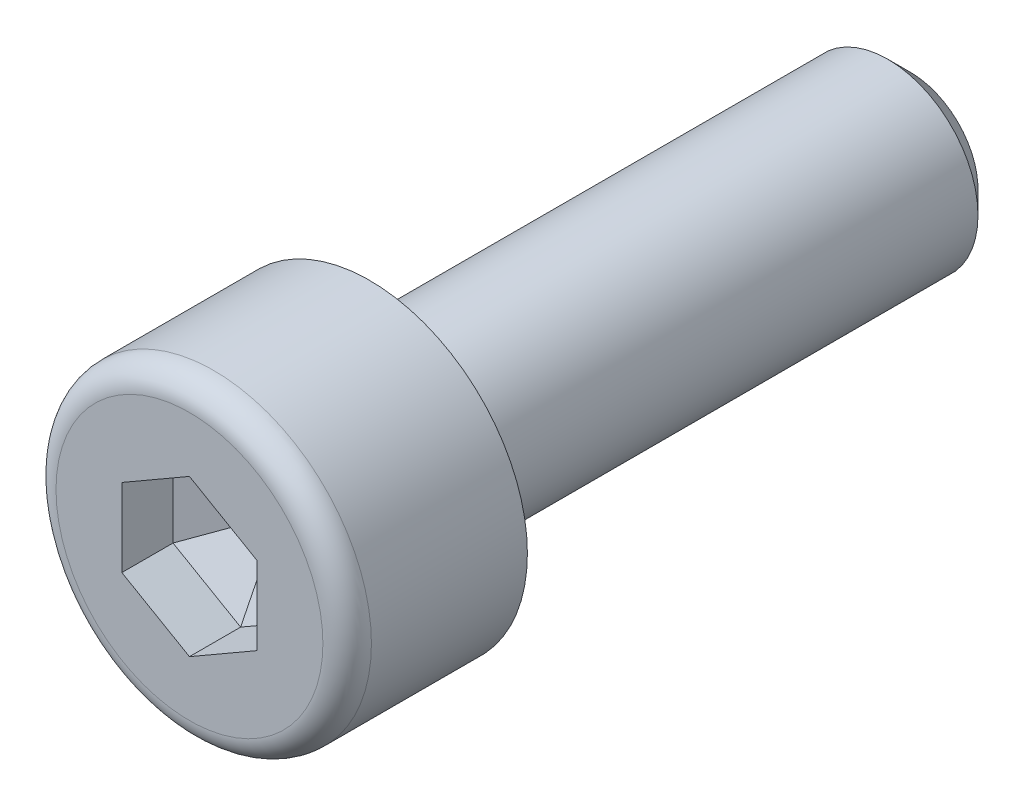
ISO-10303-21;
HEADER;
FILE_DESCRIPTION(('STEP AP214'),'2;1');
FILE_NAME('part.step','',(''),(''),'','','');
FILE_SCHEMA(('AUTOMOTIVE_DESIGN { 1 0 10303 214 1 1 1 1 }'));
ENDSEC;
DATA;
#1=APPLICATION_CONTEXT('core data for automotive mechanical design processes');
#2=APPLICATION_PROTOCOL_DEFINITION('international standard','automotive_design',2000,#1);
#3=PRODUCT_CONTEXT('',#1,'mechanical');
#4=PRODUCT('Part','Part','',(#3));
#5=PRODUCT_RELATED_PRODUCT_CATEGORY('part','',(#4));
#6=PRODUCT_DEFINITION_FORMATION('','',#4);
#7=PRODUCT_DEFINITION_CONTEXT('part definition',#1,'design');
#8=PRODUCT_DEFINITION('design','',#6,#7);
#9=PRODUCT_DEFINITION_SHAPE('','',#8);
#10=(LENGTH_UNIT() NAMED_UNIT(*) SI_UNIT(.MILLI.,.METRE.));
#11=(NAMED_UNIT(*) PLANE_ANGLE_UNIT() SI_UNIT($,.RADIAN.));
#12=(NAMED_UNIT(*) SI_UNIT($,.STERADIAN.) SOLID_ANGLE_UNIT());
#13=UNCERTAINTY_MEASURE_WITH_UNIT(LENGTH_MEASURE(1.E-05),#10,'distance_accuracy_value','');
#14=(GEOMETRIC_REPRESENTATION_CONTEXT(3) GLOBAL_UNCERTAINTY_ASSIGNED_CONTEXT((#13)) GLOBAL_UNIT_ASSIGNED_CONTEXT((#10,
#11,#12)) REPRESENTATION_CONTEXT('',''));
#15=CARTESIAN_POINT('',(0.,0.,0.));
#16=DIRECTION('',(0.,0.,1.));
#17=DIRECTION('',(1.,0.,0.));
#18=AXIS2_PLACEMENT_3D('',#15,#16,#17);
#19=CARTESIAN_POINT('',(0.,0.,0.));
#20=DIRECTION('',(0.,0.,1.));
#21=DIRECTION('',(1.,0.,0.));
#22=AXIS2_PLACEMENT_3D('',#19,#20,#21);
#23=PLANE('',#22);
#24=CARTESIAN_POINT('',(0.,0.,0.));
#25=DIRECTION('',(0.,0.,1.));
#26=DIRECTION('',(1.,0.,0.));
#27=AXIS2_PLACEMENT_3D('',#24,#25,#26);
#28=CIRCLE('',#27,2.1);
#29=CARTESIAN_POINT('',(2.1,0.,0.));
#30=VERTEX_POINT('',#29);
#31=EDGE_CURVE('E11',#30,#30,#28,.T.);
#32=ORIENTED_EDGE('',*,*,#31,.T.);
#33=EDGE_LOOP('',(#32));
#34=FACE_BOUND('',#33,.T.);
#35=CARTESIAN_POINT('',(0.,0.,0.));
#36=DIRECTION('',(0.,0.,1.));
#37=DIRECTION('',(1.,0.,0.));
#38=AXIS2_PLACEMENT_3D('',#35,#36,#37);
#39=CIRCLE('',#38,3.5);
#40=CARTESIAN_POINT('',(3.5,0.,0.));
#41=VERTEX_POINT('',#40);
#42=EDGE_CURVE('E160',#41,#41,#39,.T.);
#43=ORIENTED_EDGE('',*,*,#42,.F.);
#44=EDGE_LOOP('',(#43));
#45=FACE_BOUND('',#44,.T.);
#46=ADVANCED_FACE('F50',(#34,#45),#23,.F.);
#47=CARTESIAN_POINT('',(0.,0.,4.));
#48=DIRECTION('',(0.,0.,-1.));
#49=DIRECTION('',(-1.,0.,0.));
#50=AXIS2_PLACEMENT_3D('',#47,#48,#49);
#51=CYLINDRICAL_SURFACE('',#50,3.5);
#52=CARTESIAN_POINT('',(0.,0.,3.46153846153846));
#53=DIRECTION('',(0.,0.,1.));
#54=DIRECTION('',(1.,0.,0.));
#55=AXIS2_PLACEMENT_3D('',#52,#53,#54);
#56=CIRCLE('',#55,3.5);
#57=CARTESIAN_POINT('',(3.5,0.,3.46153846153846));
#58=VERTEX_POINT('',#57);
#59=EDGE_CURVE('E178',#58,#58,#56,.F.);
#60=ORIENTED_EDGE('',*,*,#59,.T.);
#61=EDGE_LOOP('',(#60));
#62=FACE_BOUND('',#61,.T.);
#63=ORIENTED_EDGE('',*,*,#42,.T.);
#64=EDGE_LOOP('',(#63));
#65=FACE_BOUND('',#64,.T.);
#66=ADVANCED_FACE('F237',(#62,#65),#51,.T.);
#67=CARTESIAN_POINT('',(0.,0.,4.));
#68=DIRECTION('',(0.,0.,1.));
#69=DIRECTION('',(1.,0.,0.));
#70=AXIS2_PLACEMENT_3D('',#67,#68,#69);
#71=PLANE('',#70);
#72=CARTESIAN_POINT('',(0.,0.,4.));
#73=DIRECTION('',(0.,0.,1.));
#74=DIRECTION('',(1.,0.,0.));
#75=AXIS2_PLACEMENT_3D('',#72,#73,#74);
#76=CIRCLE('',#75,2.96153846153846);
#77=CARTESIAN_POINT('',(2.96153846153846,0.,4.));
#78=VERTEX_POINT('',#77);
#79=EDGE_CURVE('E175',#78,#78,#76,.T.);
#80=ORIENTED_EDGE('',*,*,#79,.T.);
#81=EDGE_LOOP('',(#80));
#82=FACE_BOUND('',#81,.T.);
#83=DIRECTION('',(0.,1.,0.));
#84=VECTOR('',#83,1.);
#85=CARTESIAN_POINT('',(1.5,-0.866025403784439,4.));
#86=LINE('',#85,#84);
#87=CARTESIAN_POINT('',(1.5,-0.866025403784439,4.));
#88=VERTEX_POINT('',#87);
#89=CARTESIAN_POINT('',(1.5,0.866025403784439,4.));
#90=VERTEX_POINT('',#89);
#91=EDGE_CURVE('E142',#88,#90,#86,.T.);
#92=ORIENTED_EDGE('',*,*,#91,.F.);
#93=DIRECTION('',(0.866025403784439,0.5,0.));
#94=VECTOR('',#93,1.);
#95=CARTESIAN_POINT('',(0.,-1.73205080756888,4.));
#96=LINE('',#95,#94);
#97=CARTESIAN_POINT('',(0.,-1.73205080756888,4.));
#98=VERTEX_POINT('',#97);
#99=EDGE_CURVE('E155',#98,#88,#96,.T.);
#100=ORIENTED_EDGE('',*,*,#99,.F.);
#101=DIRECTION('',(0.866025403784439,-0.5,0.));
#102=VECTOR('',#101,1.);
#103=CARTESIAN_POINT('',(-1.5,-0.866025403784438,4.));
#104=LINE('',#103,#102);
#105=CARTESIAN_POINT('',(-1.5,-0.866025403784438,4.));
#106=VERTEX_POINT('',#105);
#107=EDGE_CURVE('E149',#106,#98,#104,.T.);
#108=ORIENTED_EDGE('',*,*,#107,.F.);
#109=DIRECTION('',(0.,-1.,0.));
#110=VECTOR('',#109,1.);
#111=CARTESIAN_POINT('',(-1.5,0.866025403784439,4.));
#112=LINE('',#111,#110);
#113=CARTESIAN_POINT('',(-1.5,0.866025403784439,4.));
#114=VERTEX_POINT('',#113);
#115=EDGE_CURVE('E147',#114,#106,#112,.T.);
#116=ORIENTED_EDGE('',*,*,#115,.F.);
#117=DIRECTION('',(-0.866025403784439,-0.5,0.));
#118=VECTOR('',#117,1.);
#119=CARTESIAN_POINT('',(0.,1.73205080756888,4.));
#120=LINE('',#119,#118);
#121=CARTESIAN_POINT('',(0.,1.73205080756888,4.));
#122=VERTEX_POINT('',#121);
#123=EDGE_CURVE('E127',#122,#114,#120,.T.);
#124=ORIENTED_EDGE('',*,*,#123,.F.);
#125=DIRECTION('',(-0.866025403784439,0.5,0.));
#126=VECTOR('',#125,1.);
#127=CARTESIAN_POINT('',(1.5,0.866025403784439,4.));
#128=LINE('',#127,#126);
#129=EDGE_CURVE('E137',#90,#122,#128,.T.);
#130=ORIENTED_EDGE('',*,*,#129,.F.);
#131=EDGE_LOOP('',(#92,#100,#108,#116,#124,#130));
#132=FACE_BOUND('',#131,.T.);
#133=ADVANCED_FACE('F144',(#82,#132),#71,.T.);
#134=CARTESIAN_POINT('',(1.5,-0.866025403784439,2.));
#135=DIRECTION('',(1.,0.,0.));
#136=DIRECTION('',(0.,1.,0.));
#137=AXIS2_PLACEMENT_3D('',#134,#135,#136);
#138=PLANE('',#137);
#139=DIRECTION('',(0.,0.,1.));
#140=VECTOR('',#139,1.);
#141=CARTESIAN_POINT('',(1.5,0.866025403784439,2.));
#142=LINE('',#141,#140);
#143=CARTESIAN_POINT('',(1.5,0.866025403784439,2.86455331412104));
#144=VERTEX_POINT('',#143);
#145=EDGE_CURVE('E134',#144,#90,#142,.T.);
#146=ORIENTED_EDGE('',*,*,#145,.F.);
#147=DIRECTION('',(0.,-1.,0.));
#148=VECTOR('',#147,1.);
#149=CARTESIAN_POINT('',(1.5,-0.866025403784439,2.86455331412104));
#150=LINE('',#149,#148);
#151=CARTESIAN_POINT('',(1.5,-0.866025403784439,2.86455331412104));
#152=VERTEX_POINT('',#151);
#153=EDGE_CURVE('E73',#144,#152,#150,.T.);
#154=ORIENTED_EDGE('',*,*,#153,.T.);
#155=DIRECTION('',(0.,0.,1.));
#156=VECTOR('',#155,1.);
#157=CARTESIAN_POINT('',(1.5,-0.866025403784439,2.));
#158=LINE('',#157,#156);
#159=EDGE_CURVE('E158',#152,#88,#158,.T.);
#160=ORIENTED_EDGE('',*,*,#159,.T.);
#161=ORIENTED_EDGE('',*,*,#91,.T.);
#162=EDGE_LOOP('',(#146,#154,#160,#161));
#163=FACE_BOUND('',#162,.T.);
#164=ADVANCED_FACE('F297',(#163),#138,.F.);
#165=CARTESIAN_POINT('',(0.,-1.73205080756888,2.));
#166=DIRECTION('',(0.5,-0.866025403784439,0.));
#167=DIRECTION('',(0.866025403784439,0.5,0.));
#168=AXIS2_PLACEMENT_3D('',#165,#166,#167);
#169=PLANE('',#168);
#170=ORIENTED_EDGE('',*,*,#159,.F.);
#171=DIRECTION('',(-0.866025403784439,-0.5,0.));
#172=VECTOR('',#171,1.);
#173=CARTESIAN_POINT('',(0.,-1.73205080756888,2.86455331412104));
#174=LINE('',#173,#172);
#175=CARTESIAN_POINT('',(0.,-1.73205080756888,2.86455331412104));
#176=VERTEX_POINT('',#175);
#177=EDGE_CURVE('E65',#152,#176,#174,.T.);
#178=ORIENTED_EDGE('',*,*,#177,.T.);
#179=DIRECTION('',(0.,0.,1.));
#180=VECTOR('',#179,1.);
#181=CARTESIAN_POINT('',(0.,-1.73205080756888,2.));
#182=LINE('',#181,#180);
#183=EDGE_CURVE('E161',#176,#98,#182,.T.);
#184=ORIENTED_EDGE('',*,*,#183,.T.);
#185=ORIENTED_EDGE('',*,*,#99,.T.);
#186=EDGE_LOOP('',(#170,#178,#184,#185));
#187=FACE_BOUND('',#186,.T.);
#188=ADVANCED_FACE('F299',(#187),#169,.F.);
#189=CARTESIAN_POINT('',(-1.5,-0.866025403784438,2.));
#190=DIRECTION('',(-0.5,-0.866025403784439,0.));
#191=DIRECTION('',(0.866025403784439,-0.5,0.));
#192=AXIS2_PLACEMENT_3D('',#189,#190,#191);
#193=PLANE('',#192);
#194=ORIENTED_EDGE('',*,*,#183,.F.);
#195=DIRECTION('',(-0.866025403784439,0.5,0.));
#196=VECTOR('',#195,1.);
#197=CARTESIAN_POINT('',(-1.5,-0.866025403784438,2.86455331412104));
#198=LINE('',#197,#196);
#199=CARTESIAN_POINT('',(-1.5,-0.866025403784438,2.86455331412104));
#200=VERTEX_POINT('',#199);
#201=EDGE_CURVE('E201',#176,#200,#198,.T.);
#202=ORIENTED_EDGE('',*,*,#201,.T.);
#203=DIRECTION('',(0.,0.,1.));
#204=VECTOR('',#203,1.);
#205=CARTESIAN_POINT('',(-1.5,-0.866025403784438,2.));
#206=LINE('',#205,#204);
#207=EDGE_CURVE('E163',#200,#106,#206,.T.);
#208=ORIENTED_EDGE('',*,*,#207,.T.);
#209=ORIENTED_EDGE('',*,*,#107,.T.);
#210=EDGE_LOOP('',(#194,#202,#208,#209));
#211=FACE_BOUND('',#210,.T.);
#212=ADVANCED_FACE('F288',(#211),#193,.F.);
#213=CARTESIAN_POINT('',(-1.5,0.866025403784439,2.));
#214=DIRECTION('',(-1.,0.,0.));
#215=DIRECTION('',(0.,0.,1.));
#216=AXIS2_PLACEMENT_3D('',#213,#214,#215);
#217=PLANE('',#216);
#218=ORIENTED_EDGE('',*,*,#207,.F.);
#219=DIRECTION('',(0.,1.,0.));
#220=VECTOR('',#219,1.);
#221=CARTESIAN_POINT('',(-1.5,0.866025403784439,2.86455331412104));
#222=LINE('',#221,#220);
#223=CARTESIAN_POINT('',(-1.5,0.866025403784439,2.86455331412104));
#224=VERTEX_POINT('',#223);
#225=EDGE_CURVE('E194',#200,#224,#222,.T.);
#226=ORIENTED_EDGE('',*,*,#225,.T.);
#227=DIRECTION('',(0.,0.,1.));
#228=VECTOR('',#227,1.);
#229=CARTESIAN_POINT('',(-1.5,0.866025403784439,2.));
#230=LINE('',#229,#228);
#231=EDGE_CURVE('E133',#224,#114,#230,.T.);
#232=ORIENTED_EDGE('',*,*,#231,.T.);
#233=ORIENTED_EDGE('',*,*,#115,.T.);
#234=EDGE_LOOP('',(#218,#226,#232,#233));
#235=FACE_BOUND('',#234,.T.);
#236=ADVANCED_FACE('F291',(#235),#217,.F.);
#237=CARTESIAN_POINT('',(0.,1.73205080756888,2.));
#238=DIRECTION('',(-0.5,0.866025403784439,0.));
#239=DIRECTION('',(-0.866025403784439,-0.5,0.));
#240=AXIS2_PLACEMENT_3D('',#237,#238,#239);
#241=PLANE('',#240);
#242=ORIENTED_EDGE('',*,*,#231,.F.);
#243=DIRECTION('',(0.866025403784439,0.5,0.));
#244=VECTOR('',#243,1.);
#245=CARTESIAN_POINT('',(0.,1.73205080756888,2.86455331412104));
#246=LINE('',#245,#244);
#247=CARTESIAN_POINT('',(0.,1.73205080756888,2.86455331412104));
#248=VERTEX_POINT('',#247);
#249=EDGE_CURVE('E130',#224,#248,#246,.T.);
#250=ORIENTED_EDGE('',*,*,#249,.T.);
#251=DIRECTION('',(0.,0.,1.));
#252=VECTOR('',#251,1.);
#253=CARTESIAN_POINT('',(0.,1.73205080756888,2.));
#254=LINE('',#253,#252);
#255=EDGE_CURVE('E122',#248,#122,#254,.T.);
#256=ORIENTED_EDGE('',*,*,#255,.T.);
#257=ORIENTED_EDGE('',*,*,#123,.T.);
#258=EDGE_LOOP('',(#242,#250,#256,#257));
#259=FACE_BOUND('',#258,.T.);
#260=ADVANCED_FACE('F125',(#259),#241,.F.);
#261=CARTESIAN_POINT('',(1.5,0.866025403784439,2.));
#262=DIRECTION('',(0.5,0.866025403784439,0.));
#263=DIRECTION('',(-0.866025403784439,0.5,0.));
#264=AXIS2_PLACEMENT_3D('',#261,#262,#263);
#265=PLANE('',#264);
#266=ORIENTED_EDGE('',*,*,#255,.F.);
#267=DIRECTION('',(0.866025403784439,-0.5,0.));
#268=VECTOR('',#267,1.);
#269=CARTESIAN_POINT('',(1.5,0.866025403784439,2.86455331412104));
#270=LINE('',#269,#268);
#271=EDGE_CURVE('E198',#248,#144,#270,.T.);
#272=ORIENTED_EDGE('',*,*,#271,.T.);
#273=ORIENTED_EDGE('',*,*,#145,.T.);
#274=ORIENTED_EDGE('',*,*,#129,.T.);
#275=EDGE_LOOP('',(#266,#272,#273,#274));
#276=FACE_BOUND('',#275,.T.);
#277=ADVANCED_FACE('F138',(#276),#265,.F.);
#278=CARTESIAN_POINT('',(0.,0.,2.));
#279=DIRECTION('',(0.,0.,1.));
#280=DIRECTION('',(1.,0.,0.));
#281=AXIS2_PLACEMENT_3D('',#278,#279,#280);
#282=PLANE('',#281);
#283=DIRECTION('',(-0.866025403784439,-0.5,0.));
#284=VECTOR('',#283,1.);
#285=CARTESIAN_POINT('',(-0.00127486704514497,0.00220813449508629,2.));
#286=LINE('',#285,#284);
#287=CARTESIAN_POINT('',(0.,0.00294417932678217,2.));
#288=VERTEX_POINT('',#287);
#289=CARTESIAN_POINT('',(-0.0025497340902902,0.00147208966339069,2.));
#290=VERTEX_POINT('',#289);
#291=EDGE_CURVE('E189',#288,#290,#286,.T.);
#292=ORIENTED_EDGE('',*,*,#291,.T.);
#293=DIRECTION('',(0.,-1.,0.));
#294=VECTOR('',#293,1.);
#295=CARTESIAN_POINT('',(-0.0025497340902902,0.,2.));
#296=LINE('',#295,#294);
#297=CARTESIAN_POINT('',(-0.0025497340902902,-0.00147208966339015,2.));
#298=VERTEX_POINT('',#297);
#299=EDGE_CURVE('E191',#290,#298,#296,.T.);
#300=ORIENTED_EDGE('',*,*,#299,.T.);
#301=DIRECTION('',(0.866025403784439,-0.5,0.));
#302=VECTOR('',#301,1.);
#303=CARTESIAN_POINT('',(-0.00127486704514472,-0.00220813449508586,2.));
#304=LINE('',#303,#302);
#305=CARTESIAN_POINT('',(0.,-0.00294417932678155,2.));
#306=VERTEX_POINT('',#305);
#307=EDGE_CURVE('E183',#298,#306,#304,.T.);
#308=ORIENTED_EDGE('',*,*,#307,.T.);
#309=DIRECTION('',(0.866025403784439,0.5,0.));
#310=VECTOR('',#309,1.);
#311=CARTESIAN_POINT('',(0.00127486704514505,-0.00220813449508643,2.));
#312=LINE('',#311,#310);
#313=CARTESIAN_POINT('',(0.0025497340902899,-0.00147208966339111,2.));
#314=VERTEX_POINT('',#313);
#315=EDGE_CURVE('E181',#306,#314,#312,.T.);
#316=ORIENTED_EDGE('',*,*,#315,.T.);
#317=DIRECTION('',(0.,1.,0.));
#318=VECTOR('',#317,1.);
#319=CARTESIAN_POINT('',(0.00254973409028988,0.,2.));
#320=LINE('',#319,#318);
#321=CARTESIAN_POINT('',(0.00254973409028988,0.00147208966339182,2.));
#322=VERTEX_POINT('',#321);
#323=EDGE_CURVE('E185',#314,#322,#320,.T.);
#324=ORIENTED_EDGE('',*,*,#323,.T.);
#325=DIRECTION('',(-0.866025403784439,0.5,0.));
#326=VECTOR('',#325,1.);
#327=CARTESIAN_POINT('',(0.00127486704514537,0.00220813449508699,2.));
#328=LINE('',#327,#326);
#329=EDGE_CURVE('E187',#322,#288,#328,.T.);
#330=ORIENTED_EDGE('',*,*,#329,.T.);
#331=EDGE_LOOP('',(#292,#300,#308,#316,#324,#330));
#332=FACE_BOUND('',#331,.T.);
#333=ADVANCED_FACE('F308',(#332),#282,.T.);
#334=CARTESIAN_POINT('',(0.,0.,-12.));
#335=DIRECTION('',(0.,0.,1.));
#336=DIRECTION('',(1.,0.,0.));
#337=AXIS2_PLACEMENT_3D('',#334,#335,#336);
#338=CYLINDRICAL_SURFACE('',#337,2.);
#339=CARTESIAN_POINT('',(0.,0.,-0.0999999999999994));
#340=DIRECTION('',(0.,0.,1.));
#341=DIRECTION('',(1.,0.,0.));
#342=AXIS2_PLACEMENT_3D('',#339,#340,#341);
#343=CIRCLE('',#342,2.);
#344=CARTESIAN_POINT('',(2.,0.,-0.0999999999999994));
#345=VERTEX_POINT('',#344);
#346=EDGE_CURVE('E58',#345,#345,#343,.F.);
#347=ORIENTED_EDGE('',*,*,#346,.T.);
#348=EDGE_LOOP('',(#347));
#349=FACE_BOUND('',#348,.T.);
#350=CARTESIAN_POINT('',(0.,0.,-11.5));
#351=DIRECTION('',(0.,0.,-1.));
#352=DIRECTION('',(-1.,0.,0.));
#353=AXIS2_PLACEMENT_3D('',#350,#351,#352);
#354=CIRCLE('',#353,2.);
#355=CARTESIAN_POINT('',(-2.,0.,-11.5));
#356=VERTEX_POINT('',#355);
#357=EDGE_CURVE('E172',#356,#356,#354,.F.);
#358=ORIENTED_EDGE('',*,*,#357,.T.);
#359=EDGE_LOOP('',(#358));
#360=FACE_BOUND('',#359,.T.);
#361=ADVANCED_FACE('F222',(#349,#360),#338,.T.);
#362=CARTESIAN_POINT('',(0.,0.,-12.));
#363=DIRECTION('',(0.,0.,-1.));
#364=DIRECTION('',(-1.,0.,0.));
#365=AXIS2_PLACEMENT_3D('',#362,#363,#364);
#366=PLANE('',#365);
#367=CARTESIAN_POINT('',(0.,0.,-12.));
#368=DIRECTION('',(0.,0.,-1.));
#369=DIRECTION('',(-1.,0.,0.));
#370=AXIS2_PLACEMENT_3D('',#367,#368,#369);
#371=CIRCLE('',#370,1.5);
#372=CARTESIAN_POINT('',(-1.5,0.,-12.));
#373=VERTEX_POINT('',#372);
#374=EDGE_CURVE('E169',#373,#373,#371,.T.);
#375=ORIENTED_EDGE('',*,*,#374,.T.);
#376=EDGE_LOOP('',(#375));
#377=FACE_BOUND('',#376,.T.);
#378=ADVANCED_FACE('F253',(#377),#366,.T.);
#379=CARTESIAN_POINT('',(0.,0.,-12.));
#380=DIRECTION('',(0.,0.,1.));
#381=DIRECTION('',(1.,0.,0.));
#382=AXIS2_PLACEMENT_3D('',#379,#380,#381);
#383=CONICAL_SURFACE('',#382,1.5,0.785398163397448);
#384=ORIENTED_EDGE('',*,*,#357,.F.);
#385=EDGE_LOOP('',(#384));
#386=FACE_BOUND('',#385,.T.);
#387=ORIENTED_EDGE('',*,*,#374,.F.);
#388=EDGE_LOOP('',(#387));
#389=FACE_BOUND('',#388,.T.);
#390=ADVANCED_FACE('F249',(#386,#389),#383,.T.);
#391=CARTESIAN_POINT('',(0.,0.,3.46153846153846));
#392=DIRECTION('',(0.,0.,1.));
#393=DIRECTION('',(1.,0.,0.));
#394=AXIS2_PLACEMENT_3D('',#391,#392,#393);
#395=TOROIDAL_SURFACE('',#394,2.96153846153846,0.538461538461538);
#396=ORIENTED_EDGE('',*,*,#59,.F.);
#397=EDGE_LOOP('',(#396));
#398=FACE_BOUND('',#397,.T.);
#399=ORIENTED_EDGE('',*,*,#79,.F.);
#400=EDGE_LOOP('',(#399));
#401=FACE_BOUND('',#400,.T.);
#402=ADVANCED_FACE('F252',(#398,#401),#395,.T.);
#403=CARTESIAN_POINT('',(0.00254973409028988,0.,2.));
#404=DIRECTION('',(0.499999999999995,0.,-0.866025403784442));
#405=DIRECTION('',(0.,1.,0.));
#406=AXIS2_PLACEMENT_3D('',#403,#404,#405);
#407=PLANE('',#406);
#408=DIRECTION('',(-0.774596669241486,0.447213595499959,-0.447213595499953));
#409=VECTOR('',#408,1.);
#410=CARTESIAN_POINT('',(0.00203978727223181,-0.00117767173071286,1.99970558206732));
#411=LINE('',#410,#409);
#412=EDGE_CURVE('E214',#152,#314,#411,.T.);
#413=ORIENTED_EDGE('',*,*,#412,.F.);
#414=ORIENTED_EDGE('',*,*,#153,.F.);
#415=DIRECTION('',(-0.774596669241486,-0.447213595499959,-0.447213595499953));
#416=VECTOR('',#415,1.);
#417=CARTESIAN_POINT('',(0.00203978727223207,0.00117767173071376,1.99970558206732));
#418=LINE('',#417,#416);
#419=EDGE_CURVE('E217',#322,#144,#418,.F.);
#420=ORIENTED_EDGE('',*,*,#419,.F.);
#421=ORIENTED_EDGE('',*,*,#323,.F.);
#422=EDGE_LOOP('',(#413,#414,#420,#421));
#423=FACE_BOUND('',#422,.T.);
#424=ADVANCED_FACE('F256',(#423),#407,.F.);
#425=CARTESIAN_POINT('',(0.00127486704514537,0.00220813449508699,2.));
#426=DIRECTION('',(0.249999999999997,0.433012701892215,-0.866025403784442));
#427=DIRECTION('',(-0.866025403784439,0.5,0.));
#428=AXIS2_PLACEMENT_3D('',#425,#426,#427);
#429=PLANE('',#428);
#430=ORIENTED_EDGE('',*,*,#419,.T.);
#431=ORIENTED_EDGE('',*,*,#271,.F.);
#432=DIRECTION('',(0.,-0.894427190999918,-0.447213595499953));
#433=VECTOR('',#432,1.);
#434=CARTESIAN_POINT('',(0.,0.00235534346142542,1.99970558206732));
#435=LINE('',#434,#433);
#436=EDGE_CURVE('E211',#288,#248,#435,.F.);
#437=ORIENTED_EDGE('',*,*,#436,.F.);
#438=ORIENTED_EDGE('',*,*,#329,.F.);
#439=EDGE_LOOP('',(#430,#431,#437,#438));
#440=FACE_BOUND('',#439,.T.);
#441=ADVANCED_FACE('F269',(#440),#429,.F.);
#442=CARTESIAN_POINT('',(0.00127486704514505,-0.00220813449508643,2.));
#443=DIRECTION('',(0.249999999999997,-0.433012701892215,-0.866025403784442));
#444=DIRECTION('',(0.866025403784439,0.5,0.));
#445=AXIS2_PLACEMENT_3D('',#442,#443,#444);
#446=PLANE('',#445);
#447=ORIENTED_EDGE('',*,*,#412,.T.);
#448=ORIENTED_EDGE('',*,*,#315,.F.);
#449=DIRECTION('',(0.,-0.894427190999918,0.447213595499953));
#450=VECTOR('',#449,1.);
#451=CARTESIAN_POINT('',(0.,-0.00235534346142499,1.99970558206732));
#452=LINE('',#451,#450);
#453=EDGE_CURVE('E208',#176,#306,#452,.F.);
#454=ORIENTED_EDGE('',*,*,#453,.F.);
#455=ORIENTED_EDGE('',*,*,#177,.F.);
#456=EDGE_LOOP('',(#447,#448,#454,#455));
#457=FACE_BOUND('',#456,.T.);
#458=ADVANCED_FACE('F265',(#457),#446,.F.);
#459=CARTESIAN_POINT('',(-0.00127486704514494,0.00220813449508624,2.));
#460=DIRECTION('',(-0.249999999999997,0.433012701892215,-0.866025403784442));
#461=DIRECTION('',(-0.866025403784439,-0.5,0.));
#462=AXIS2_PLACEMENT_3D('',#459,#460,#461);
#463=PLANE('',#462);
#464=ORIENTED_EDGE('',*,*,#436,.T.);
#465=ORIENTED_EDGE('',*,*,#249,.F.);
#466=DIRECTION('',(0.774596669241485,-0.44721359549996,-0.447213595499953));
#467=VECTOR('',#466,1.);
#468=CARTESIAN_POINT('',(-0.00203978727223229,0.00117767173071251,1.99970558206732));
#469=LINE('',#468,#467);
#470=EDGE_CURVE('E206',#290,#224,#469,.F.);
#471=ORIENTED_EDGE('',*,*,#470,.F.);
#472=ORIENTED_EDGE('',*,*,#291,.F.);
#473=EDGE_LOOP('',(#464,#465,#471,#472));
#474=FACE_BOUND('',#473,.T.);
#475=ADVANCED_FACE('F261',(#474),#463,.F.);
#476=CARTESIAN_POINT('',(-0.00127486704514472,-0.00220813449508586,2.));
#477=DIRECTION('',(-0.249999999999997,-0.433012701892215,-0.866025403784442));
#478=DIRECTION('',(0.866025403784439,-0.5,0.));
#479=AXIS2_PLACEMENT_3D('',#476,#477,#478);
#480=PLANE('',#479);
#481=ORIENTED_EDGE('',*,*,#453,.T.);
#482=ORIENTED_EDGE('',*,*,#307,.F.);
#483=DIRECTION('',(-0.774596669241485,-0.447213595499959,0.447213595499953));
#484=VECTOR('',#483,1.);
#485=CARTESIAN_POINT('',(-0.00203978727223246,-0.00117767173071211,1.99970558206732));
#486=LINE('',#485,#484);
#487=EDGE_CURVE('E204',#200,#298,#486,.F.);
#488=ORIENTED_EDGE('',*,*,#487,.F.);
#489=ORIENTED_EDGE('',*,*,#201,.F.);
#490=EDGE_LOOP('',(#481,#482,#488,#489));
#491=FACE_BOUND('',#490,.T.);
#492=ADVANCED_FACE('F232',(#491),#480,.F.);
#493=CARTESIAN_POINT('',(-0.0025497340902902,0.,2.));
#494=DIRECTION('',(-0.499999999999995,0.,-0.866025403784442));
#495=DIRECTION('',(0.,-1.,0.));
#496=AXIS2_PLACEMENT_3D('',#493,#494,#495);
#497=PLANE('',#496);
#498=ORIENTED_EDGE('',*,*,#470,.T.);
#499=ORIENTED_EDGE('',*,*,#225,.F.);
#500=ORIENTED_EDGE('',*,*,#487,.T.);
#501=ORIENTED_EDGE('',*,*,#299,.F.);
#502=EDGE_LOOP('',(#498,#499,#500,#501));
#503=FACE_BOUND('',#502,.T.);
#504=ADVANCED_FACE('F226',(#503),#497,.F.);
#505=CARTESIAN_POINT('',(0.,0.,-0.0999999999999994));
#506=DIRECTION('',(0.,0.,1.));
#507=DIRECTION('',(1.,0.,0.));
#508=AXIS2_PLACEMENT_3D('',#505,#506,#507);
#509=TOROIDAL_SURFACE('',#508,2.1,0.1);
#510=ORIENTED_EDGE('',*,*,#31,.F.);
#511=EDGE_LOOP('',(#510));
#512=FACE_BOUND('',#511,.T.);
#513=ORIENTED_EDGE('',*,*,#346,.F.);
#514=EDGE_LOOP('',(#513));
#515=FACE_BOUND('',#514,.T.);
#516=ADVANCED_FACE('F52',(#512,#515),#509,.F.);
#517=CLOSED_SHELL('',(#46,#66,#133,#164,#188,#212,#236,#260,#277,#333,#361,#378,#390,#402,#424,
#441,#458,#475,#492,#504,#516));
#518=MANIFOLD_SOLID_BREP('B2',#517);
#519=ADVANCED_BREP_SHAPE_REPRESENTATION('',(#18,#518),#14);
#520=SHAPE_DEFINITION_REPRESENTATION(#9,#519);
ENDSEC;
END-ISO-10303-21;
